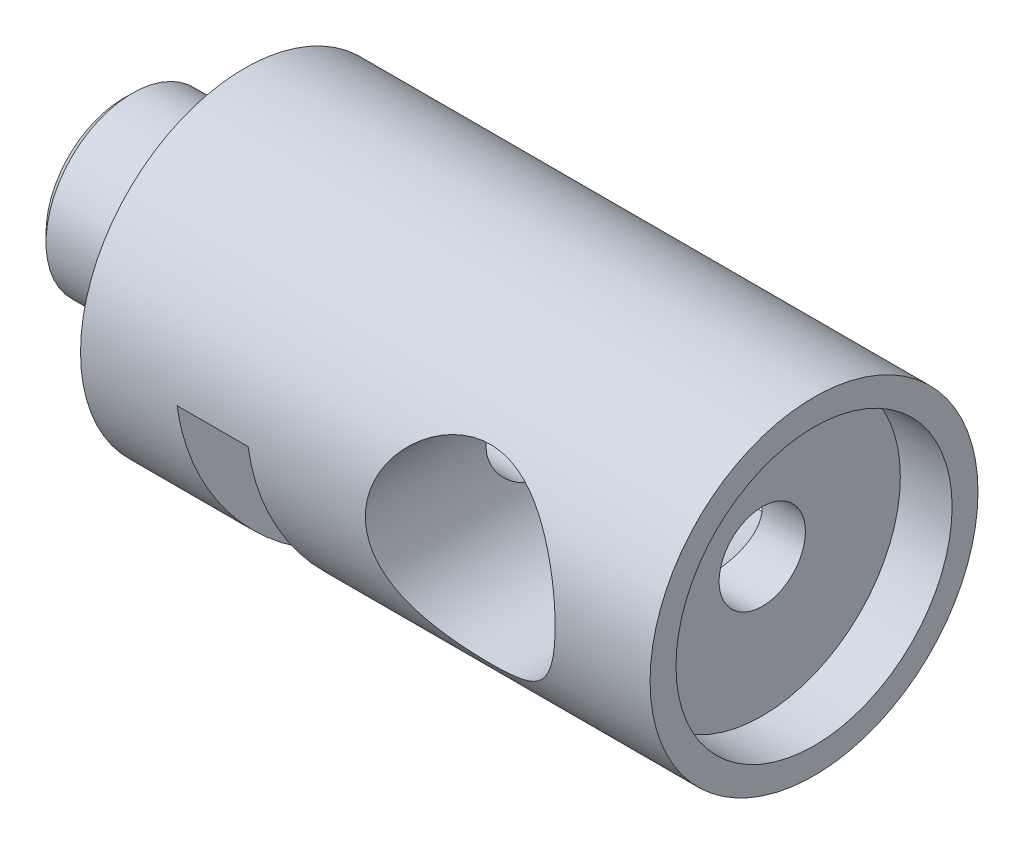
ISO-10303-21;
HEADER;
FILE_DESCRIPTION(('STEP AP214'),'2;1');
FILE_NAME('part.step','',(''),(''),'','','');
FILE_SCHEMA(('AUTOMOTIVE_DESIGN { 1 0 10303 214 1 1 1 1 }'));
ENDSEC;
DATA;
#1=APPLICATION_CONTEXT('core data for automotive mechanical design processes');
#2=APPLICATION_PROTOCOL_DEFINITION('international standard','automotive_design',2000,#1);
#3=PRODUCT_CONTEXT('',#1,'mechanical');
#4=PRODUCT('Part','Part','',(#3));
#5=PRODUCT_RELATED_PRODUCT_CATEGORY('part','',(#4));
#6=PRODUCT_DEFINITION_FORMATION('','',#4);
#7=PRODUCT_DEFINITION_CONTEXT('part definition',#1,'design');
#8=PRODUCT_DEFINITION('design','',#6,#7);
#9=PRODUCT_DEFINITION_SHAPE('','',#8);
#10=(LENGTH_UNIT() NAMED_UNIT(*) SI_UNIT(.MILLI.,.METRE.));
#11=(NAMED_UNIT(*) PLANE_ANGLE_UNIT() SI_UNIT($,.RADIAN.));
#12=(NAMED_UNIT(*) SI_UNIT($,.STERADIAN.) SOLID_ANGLE_UNIT());
#13=UNCERTAINTY_MEASURE_WITH_UNIT(LENGTH_MEASURE(1.E-05),#10,'distance_accuracy_value','');
#14=(GEOMETRIC_REPRESENTATION_CONTEXT(3) GLOBAL_UNCERTAINTY_ASSIGNED_CONTEXT((#13)) GLOBAL_UNIT_ASSIGNED_CONTEXT((#10,
#11,#12)) REPRESENTATION_CONTEXT('',''));
#15=CARTESIAN_POINT('',(0.,0.,0.));
#16=DIRECTION('',(0.,0.,1.));
#17=DIRECTION('',(1.,0.,0.));
#18=AXIS2_PLACEMENT_3D('',#15,#16,#17);
#19=CARTESIAN_POINT('',(-24.,0.,0.));
#20=DIRECTION('',(1.,0.,0.));
#21=DIRECTION('',(0.,0.,-1.));
#22=AXIS2_PLACEMENT_3D('',#19,#20,#21);
#23=PLANE('',#22);
#24=CARTESIAN_POINT('',(-24.,0.,0.));
#25=DIRECTION('',(-1.,0.,0.));
#26=DIRECTION('',(0.,0.,-1.));
#27=AXIS2_PLACEMENT_3D('',#24,#25,#26);
#28=CIRCLE('',#27,4.75);
#29=CARTESIAN_POINT('',(-24.,0.,-4.75));
#30=VERTEX_POINT('',#29);
#31=EDGE_CURVE('E455',#30,#30,#28,.T.);
#32=ORIENTED_EDGE('',*,*,#31,.T.);
#33=EDGE_LOOP('',(#32));
#34=FACE_BOUND('',#33,.T.);
#35=CARTESIAN_POINT('',(-24.,0.,0.));
#36=DIRECTION('',(1.,0.,0.));
#37=DIRECTION('',(0.,0.,-1.));
#38=AXIS2_PLACEMENT_3D('',#35,#36,#37);
#39=CIRCLE('',#38,2.5);
#40=CARTESIAN_POINT('',(-24.,0.,-2.5));
#41=VERTEX_POINT('',#40);
#42=EDGE_CURVE('E461',#41,#41,#39,.F.);
#43=ORIENTED_EDGE('',*,*,#42,.F.);
#44=EDGE_LOOP('',(#43));
#45=FACE_BOUND('',#44,.T.);
#46=ADVANCED_FACE('F362',(#34,#45),#23,.F.);
#47=CARTESIAN_POINT('',(-7.5,0.,0.));
#48=DIRECTION('',(-1.,0.,0.));
#49=DIRECTION('',(0.,0.,1.));
#50=AXIS2_PLACEMENT_3D('',#47,#48,#49);
#51=CYLINDRICAL_SURFACE('',#50,4.75);
#52=CARTESIAN_POINT('',(-10.25,0.,-4.75));
#53=CARTESIAN_POINT('',(-10.2500080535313,-0.141518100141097,-4.74999272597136));
#54=CARTESIAN_POINT('',(-10.260998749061,-0.283259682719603,-4.74360637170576));
#55=CARTESIAN_POINT('',(-10.3044182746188,-0.56249929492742,-4.71867095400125));
#56=CARTESIAN_POINT('',(-10.336898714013,-0.699986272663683,-4.70009261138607));
#57=CARTESIAN_POINT('',(-10.4215243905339,-0.966108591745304,-4.65266785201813));
#58=CARTESIAN_POINT('',(-10.4735760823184,-1.0947826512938,-4.62387031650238));
#59=CARTESIAN_POINT('',(-10.5953067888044,-1.34121485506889,-4.55849953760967));
#60=CARTESIAN_POINT('',(-10.6649816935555,-1.45897553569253,-4.52192810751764));
#61=CARTESIAN_POINT('',(-10.8256953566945,-1.69000944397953,-4.44099374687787));
#62=CARTESIAN_POINT('',(-10.917926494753,-1.80231953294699,-4.39625602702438));
#63=CARTESIAN_POINT('',(-11.1184882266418,-2.01081458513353,-4.30489379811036));
#64=CARTESIAN_POINT('',(-11.2268380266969,-2.10698001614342,-4.25826708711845));
#65=CARTESIAN_POINT('',(-11.47093413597,-2.29137846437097,-4.16221754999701));
#66=CARTESIAN_POINT('',(-11.6083905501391,-2.37750879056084,-4.11306851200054));
#67=CARTESIAN_POINT('',(-11.8987029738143,-2.52508415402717,-4.02416580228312));
#68=CARTESIAN_POINT('',(-12.051534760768,-2.58656728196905,-3.98439767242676));
#69=CARTESIAN_POINT('',(-12.3328426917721,-2.67091959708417,-3.92818686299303));
#70=CARTESIAN_POINT('',(-12.4589923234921,-2.69938120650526,-3.90850087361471));
#71=CARTESIAN_POINT('',(-12.7152769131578,-2.73828086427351,-3.88135349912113));
#72=CARTESIAN_POINT('',(-12.8454072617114,-2.74873901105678,-3.87387848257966));
#73=CARTESIAN_POINT('',(-13.1061129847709,-2.75104732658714,-3.87223991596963));
#74=CARTESIAN_POINT('',(-13.236688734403,-2.74286942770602,-3.87809644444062));
#75=CARTESIAN_POINT('',(-13.4942556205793,-2.70834331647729,-3.90228141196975));
#76=CARTESIAN_POINT('',(-13.6212441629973,-2.68198228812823,-3.92061864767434));
#77=CARTESIAN_POINT('',(-13.8677445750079,-2.61262939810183,-3.96716224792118));
#78=CARTESIAN_POINT('',(-13.9872968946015,-2.56973873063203,-3.9953084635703));
#79=CARTESIAN_POINT('',(-14.2178656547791,-2.46883826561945,-4.05843239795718));
#80=CARTESIAN_POINT('',(-14.3288788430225,-2.41082274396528,-4.09341270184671));
#81=CARTESIAN_POINT('',(-14.5585725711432,-2.27031384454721,-4.1732132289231));
#82=CARTESIAN_POINT('',(-14.6755205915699,-2.18536569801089,-4.21870613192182));
#83=CARTESIAN_POINT('',(-14.894634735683,-1.99841142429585,-4.31042096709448));
#84=CARTESIAN_POINT('',(-14.9967876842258,-1.8963902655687,-4.35664350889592));
#85=CARTESIAN_POINT('',(-15.1958540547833,-1.66339084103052,-4.45120209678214));
#86=CARTESIAN_POINT('',(-15.290661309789,-1.53040586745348,-4.49912422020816));
#87=CARTESIAN_POINT('',(-15.4147620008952,-1.31839139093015,-4.56397292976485));
#88=CARTESIAN_POINT('',(-15.4531223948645,-1.2455983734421,-4.58442360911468));
#89=CARTESIAN_POINT('',(-15.5233954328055,-1.09625352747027,-4.62240699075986));
#90=CARTESIAN_POINT('',(-15.5553119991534,-1.01970402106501,-4.63994146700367));
#91=CARTESIAN_POINT('',(-15.610351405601,-0.868668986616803,-4.6704868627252));
#92=CARTESIAN_POINT('',(-15.633921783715,-0.794391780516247,-4.68372293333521));
#93=CARTESIAN_POINT('',(-15.6747548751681,-0.643645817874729,-4.70680675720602));
#94=CARTESIAN_POINT('',(-15.6920210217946,-0.567178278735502,-4.71665635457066));
#95=CARTESIAN_POINT('',(-15.7199856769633,-0.41271125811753,-4.73267253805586));
#96=CARTESIAN_POINT('',(-15.7306881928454,-0.334712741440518,-4.73884137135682));
#97=CARTESIAN_POINT('',(-15.7453708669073,-0.177905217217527,-4.74731816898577));
#98=CARTESIAN_POINT('',(-15.7493518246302,-0.0990963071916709,-4.74962659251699));
#99=CARTESIAN_POINT('',(-15.7509287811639,0.11766230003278,-4.75053447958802));
#100=CARTESIAN_POINT('',(-15.7415235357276,0.25576524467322,-4.74506926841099));
#101=CARTESIAN_POINT('',(-15.7023494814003,0.52797359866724,-4.72254676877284));
#102=CARTESIAN_POINT('',(-15.67258049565,0.662078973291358,-4.70548937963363));
#103=CARTESIAN_POINT('',(-15.5946473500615,0.921055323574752,-4.66167074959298));
#104=CARTESIAN_POINT('',(-15.5467402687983,1.04602748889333,-4.63504537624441));
#105=CARTESIAN_POINT('',(-15.4342907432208,1.28620964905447,-4.57422549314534));
#106=CARTESIAN_POINT('',(-15.3697444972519,1.4014174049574,-4.54002925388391));
#107=CARTESIAN_POINT('',(-15.2182855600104,1.63176038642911,-4.46274678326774));
#108=CARTESIAN_POINT('',(-15.1297424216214,1.74563532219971,-4.41910537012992));
#109=CARTESIAN_POINT('',(-14.9365352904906,1.95779357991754,-4.32930102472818));
#110=CARTESIAN_POINT('',(-14.8318526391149,2.05605858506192,-4.28313521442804));
#111=CARTESIAN_POINT('',(-14.59499956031,2.24591366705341,-4.1869987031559));
#112=CARTESIAN_POINT('',(-14.4610473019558,2.33538971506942,-4.13721194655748));
#113=CARTESIAN_POINT('',(-14.1774426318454,2.49041291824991,-4.0457966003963));
#114=CARTESIAN_POINT('',(-14.0278105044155,2.55599050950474,-4.00415766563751));
#115=CARTESIAN_POINT('',(-13.7497105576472,2.64897483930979,-3.94307501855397));
#116=CARTESIAN_POINT('',(-13.6236020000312,2.68155533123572,-3.92078480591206));
#117=CARTESIAN_POINT('',(-13.366591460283,2.72857562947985,-3.88821531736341));
#118=CARTESIAN_POINT('',(-13.2356954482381,2.7430372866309,-3.87792157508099));
#119=CARTESIAN_POINT('',(-12.9724838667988,2.75302143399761,-3.87084210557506));
#120=CARTESIAN_POINT('',(-12.8401656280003,2.74849799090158,-3.87408913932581));
#121=CARTESIAN_POINT('',(-12.5784779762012,2.72069068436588,-3.89366312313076));
#122=CARTESIAN_POINT('',(-12.4491104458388,2.69739517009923,-3.90999819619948));
#123=CARTESIAN_POINT('',(-12.1999142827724,2.6341032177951,-3.95289740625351));
#124=CARTESIAN_POINT('',(-12.0799286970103,2.59453503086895,-3.97919797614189));
#125=CARTESIAN_POINT('',(-11.8480583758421,2.50024292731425,-4.03910842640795));
#126=CARTESIAN_POINT('',(-11.7361765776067,2.44551354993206,-4.07272093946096));
#127=CARTESIAN_POINT('',(-11.5052228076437,2.3126887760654,-4.14978647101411));
#128=CARTESIAN_POINT('',(-11.3877165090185,2.23228834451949,-4.19395738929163));
#129=CARTESIAN_POINT('',(-11.1667133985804,2.05467407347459,-4.28377540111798));
#130=CARTESIAN_POINT('',(-11.063229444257,1.95744498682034,-4.3294238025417));
#131=CARTESIAN_POINT('',(-10.8590511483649,1.73343125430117,-4.42429909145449));
#132=CARTESIAN_POINT('',(-10.7606058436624,1.60443008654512,-4.47318098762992));
#133=CARTESIAN_POINT('',(-10.5869586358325,1.32897131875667,-4.56258994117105));
#134=CARTESIAN_POINT('',(-10.511743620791,1.18252363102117,-4.60312170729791));
#135=CARTESIAN_POINT('',(-10.3990568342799,0.903358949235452,-4.66509600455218));
#136=CARTESIAN_POINT('',(-10.3572450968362,0.772854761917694,-4.68865424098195));
#137=CARTESIAN_POINT('',(-10.293459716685,0.505832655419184,-4.72489764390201));
#138=CARTESIAN_POINT('',(-10.2714309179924,0.36933257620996,-4.73761303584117));
#139=CARTESIAN_POINT('',(-10.2565296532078,0.193329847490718,-4.74622255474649));
#140=CARTESIAN_POINT('',(-10.2540836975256,0.154725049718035,-4.74763671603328));
#141=CARTESIAN_POINT('',(-10.2508176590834,0.0774190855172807,-4.74952649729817));
#142=CARTESIAN_POINT('',(-10.2499977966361,0.038717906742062,-4.75000199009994));
#143=CARTESIAN_POINT('',(-10.25,0.,-4.75));
#144=B_SPLINE_CURVE_WITH_KNOTS('',3,(#52,#53,#54,#55,#56,#57,#58,#59,#60,#61,#62,#63,#64,#65,
#66,#67,#68,#69,#70,#71,#72,#73,#74,#75,#76,#77,#78,#79,#80,#81,#82,#83,#84,#85,#86,#87,#88,#89,
#90,#91,#92,#93,#94,#95,#96,#97,#98,#99,#100,#101,#102,#103,#104,#105,#106,#107,#108,#109,#110,
#111,#112,#113,#114,#115,#116,#117,#118,#119,#120,#121,#122,#123,#124,#125,#126,#127,#128,#129,
#130,#131,#132,#133,#134,#135,#136,#137,#138,#139,#140,#141,#142,#143),.UNSPECIFIED.,.T.,.F.,(4,
2,2,2,2,2,2,2,2,2,2,2,2,2,2,2,2,2,2,2,2,2,2,2,2,2,2,2,2,2,2,2,2,2,2,2,2,2,2,2,2,2,2,2,2,4),(0.,
0.424391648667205,0.849806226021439,1.27321276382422,1.69652064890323,2.1508860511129,
2.6057972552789,3.11178128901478,3.61698031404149,4.00772417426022,4.39803153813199,
4.78892712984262,5.18009851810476,5.56891225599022,5.95787335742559,6.41068026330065,
6.86388795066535,7.3715782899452,7.62562931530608,7.87952522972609,8.11631815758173,
8.3529819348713,8.58950107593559,8.82599208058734,9.23933874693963,9.6526890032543,
10.0603876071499,10.4681794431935,10.9184944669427,11.3693340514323,11.8727379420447,
12.3754984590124,12.7702488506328,13.1645227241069,13.559751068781,13.9552248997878,
14.3408967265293,14.7267076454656,15.1722095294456,15.6181171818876,16.1240253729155,
16.6296474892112,17.0450477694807,17.4592862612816,17.5753797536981,17.6914889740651),.UNSPECIFIED.);
#145=CARTESIAN_POINT('',(-10.25,0.,-4.75));
#146=VERTEX_POINT('',#145);
#147=EDGE_CURVE('E541',#146,#146,#144,.T.);
#148=ORIENTED_EDGE('',*,*,#147,.F.);
#149=EDGE_LOOP('',(#148));
#150=FACE_BOUND('',#149,.T.);
#151=CARTESIAN_POINT('',(-10.25,0.,4.75));
#152=CARTESIAN_POINT('',(-10.2500080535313,0.141518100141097,4.74999272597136));
#153=CARTESIAN_POINT('',(-10.260998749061,0.283259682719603,4.74360637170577));
#154=CARTESIAN_POINT('',(-10.3044182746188,0.56249929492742,4.71867095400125));
#155=CARTESIAN_POINT('',(-10.336898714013,0.699986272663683,4.70009261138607));
#156=CARTESIAN_POINT('',(-10.4215243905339,0.966108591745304,4.65266785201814));
#157=CARTESIAN_POINT('',(-10.4735760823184,1.0947826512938,4.62387031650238));
#158=CARTESIAN_POINT('',(-10.5953067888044,1.34121485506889,4.55849953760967));
#159=CARTESIAN_POINT('',(-10.6649816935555,1.45897553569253,4.52192810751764));
#160=CARTESIAN_POINT('',(-10.8256953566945,1.69000944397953,4.44099374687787));
#161=CARTESIAN_POINT('',(-10.917926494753,1.80231953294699,4.39625602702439));
#162=CARTESIAN_POINT('',(-11.1184882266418,2.01081458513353,4.30489379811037));
#163=CARTESIAN_POINT('',(-11.2268380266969,2.10698001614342,4.25826708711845));
#164=CARTESIAN_POINT('',(-11.47093413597,2.29137846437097,4.16221754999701));
#165=CARTESIAN_POINT('',(-11.6083905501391,2.37750879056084,4.11306851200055));
#166=CARTESIAN_POINT('',(-11.8987029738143,2.52508415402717,4.02416580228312));
#167=CARTESIAN_POINT('',(-12.051534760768,2.58656728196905,3.98439767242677));
#168=CARTESIAN_POINT('',(-12.3328426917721,2.67091959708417,3.92818686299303));
#169=CARTESIAN_POINT('',(-12.4589923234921,2.69938120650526,3.90850087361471));
#170=CARTESIAN_POINT('',(-12.7152769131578,2.73828086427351,3.88135349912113));
#171=CARTESIAN_POINT('',(-12.8454072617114,2.74873901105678,3.87387848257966));
#172=CARTESIAN_POINT('',(-13.1061129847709,2.75104732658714,3.87223991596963));
#173=CARTESIAN_POINT('',(-13.236688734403,2.74286942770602,3.87809644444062));
#174=CARTESIAN_POINT('',(-13.4942556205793,2.70834331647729,3.90228141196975));
#175=CARTESIAN_POINT('',(-13.6212441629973,2.68198228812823,3.92061864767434));
#176=CARTESIAN_POINT('',(-13.8677445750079,2.61262939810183,3.96716224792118));
#177=CARTESIAN_POINT('',(-13.9872968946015,2.56973873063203,3.99530846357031));
#178=CARTESIAN_POINT('',(-14.2178656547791,2.46883826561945,4.05843239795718));
#179=CARTESIAN_POINT('',(-14.3288788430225,2.41082274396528,4.09341270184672));
#180=CARTESIAN_POINT('',(-14.5585725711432,2.27031384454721,4.1732132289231));
#181=CARTESIAN_POINT('',(-14.6755205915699,2.18536569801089,4.21870613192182));
#182=CARTESIAN_POINT('',(-14.894634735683,1.99841142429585,4.31042096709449));
#183=CARTESIAN_POINT('',(-14.9967876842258,1.8963902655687,4.35664350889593));
#184=CARTESIAN_POINT('',(-15.1958540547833,1.66339084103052,4.45120209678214));
#185=CARTESIAN_POINT('',(-15.290661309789,1.53040586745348,4.49912422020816));
#186=CARTESIAN_POINT('',(-15.4147620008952,1.31839139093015,4.56397292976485));
#187=CARTESIAN_POINT('',(-15.4531223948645,1.2455983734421,4.58442360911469));
#188=CARTESIAN_POINT('',(-15.5233954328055,1.09625352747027,4.62240699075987));
#189=CARTESIAN_POINT('',(-15.5553119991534,1.01970402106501,4.63994146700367));
#190=CARTESIAN_POINT('',(-15.610351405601,0.868668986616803,4.67048686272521));
#191=CARTESIAN_POINT('',(-15.633921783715,0.794391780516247,4.68372293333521));
#192=CARTESIAN_POINT('',(-15.6747548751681,0.643645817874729,4.70680675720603));
#193=CARTESIAN_POINT('',(-15.6920210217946,0.567178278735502,4.71665635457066));
#194=CARTESIAN_POINT('',(-15.7199856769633,0.41271125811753,4.73267253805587));
#195=CARTESIAN_POINT('',(-15.7306881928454,0.334712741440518,4.73884137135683));
#196=CARTESIAN_POINT('',(-15.7453708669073,0.177905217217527,4.74731816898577));
#197=CARTESIAN_POINT('',(-15.7493518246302,0.0990963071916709,4.749626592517));
#198=CARTESIAN_POINT('',(-15.7509287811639,-0.11766230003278,4.75053447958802));
#199=CARTESIAN_POINT('',(-15.7415235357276,-0.25576524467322,4.745069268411));
#200=CARTESIAN_POINT('',(-15.7023494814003,-0.52797359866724,4.72254676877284));
#201=CARTESIAN_POINT('',(-15.67258049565,-0.662078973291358,4.70548937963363));
#202=CARTESIAN_POINT('',(-15.5946473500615,-0.921055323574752,4.66167074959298));
#203=CARTESIAN_POINT('',(-15.5467402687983,-1.04602748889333,4.63504537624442));
#204=CARTESIAN_POINT('',(-15.4342907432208,-1.28620964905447,4.57422549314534));
#205=CARTESIAN_POINT('',(-15.3697444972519,-1.4014174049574,4.54002925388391));
#206=CARTESIAN_POINT('',(-15.2182855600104,-1.63176038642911,4.46274678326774));
#207=CARTESIAN_POINT('',(-15.1297424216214,-1.74563532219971,4.41910537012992));
#208=CARTESIAN_POINT('',(-14.9365352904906,-1.95779357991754,4.32930102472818));
#209=CARTESIAN_POINT('',(-14.8318526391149,-2.05605858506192,4.28313521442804));
#210=CARTESIAN_POINT('',(-14.59499956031,-2.24591366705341,4.1869987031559));
#211=CARTESIAN_POINT('',(-14.4610473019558,-2.33538971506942,4.13721194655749));
#212=CARTESIAN_POINT('',(-14.1774426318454,-2.49041291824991,4.0457966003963));
#213=CARTESIAN_POINT('',(-14.0278105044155,-2.55599050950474,4.00415766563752));
#214=CARTESIAN_POINT('',(-13.7497105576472,-2.64897483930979,3.94307501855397));
#215=CARTESIAN_POINT('',(-13.6236020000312,-2.68155533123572,3.92078480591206));
#216=CARTESIAN_POINT('',(-13.366591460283,-2.72857562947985,3.88821531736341));
#217=CARTESIAN_POINT('',(-13.2356954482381,-2.7430372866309,3.87792157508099));
#218=CARTESIAN_POINT('',(-12.9724838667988,-2.75302143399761,3.87084210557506));
#219=CARTESIAN_POINT('',(-12.8401656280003,-2.74849799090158,3.87408913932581));
#220=CARTESIAN_POINT('',(-12.5784779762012,-2.72069068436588,3.89366312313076));
#221=CARTESIAN_POINT('',(-12.4491104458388,-2.69739517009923,3.90999819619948));
#222=CARTESIAN_POINT('',(-12.1999142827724,-2.6341032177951,3.95289740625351));
#223=CARTESIAN_POINT('',(-12.0799286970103,-2.59453503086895,3.9791979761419));
#224=CARTESIAN_POINT('',(-11.8480583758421,-2.50024292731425,4.03910842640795));
#225=CARTESIAN_POINT('',(-11.7361765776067,-2.44551354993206,4.07272093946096));
#226=CARTESIAN_POINT('',(-11.5052228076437,-2.3126887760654,4.14978647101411));
#227=CARTESIAN_POINT('',(-11.3877165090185,-2.23228834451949,4.19395738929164));
#228=CARTESIAN_POINT('',(-11.1667133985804,-2.05467407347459,4.28377540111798));
#229=CARTESIAN_POINT('',(-11.063229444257,-1.95744498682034,4.32942380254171));
#230=CARTESIAN_POINT('',(-10.8590511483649,-1.73343125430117,4.42429909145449));
#231=CARTESIAN_POINT('',(-10.7606058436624,-1.60443008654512,4.47318098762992));
#232=CARTESIAN_POINT('',(-10.5869586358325,-1.32897131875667,4.56258994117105));
#233=CARTESIAN_POINT('',(-10.511743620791,-1.18252363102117,4.60312170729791));
#234=CARTESIAN_POINT('',(-10.3990568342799,-0.903358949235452,4.66509600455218));
#235=CARTESIAN_POINT('',(-10.3572450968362,-0.772854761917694,4.68865424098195));
#236=CARTESIAN_POINT('',(-10.293459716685,-0.505832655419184,4.72489764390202));
#237=CARTESIAN_POINT('',(-10.2714309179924,-0.36933257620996,4.73761303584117));
#238=CARTESIAN_POINT('',(-10.2565296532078,-0.193329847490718,4.74622255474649));
#239=CARTESIAN_POINT('',(-10.2540836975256,-0.154725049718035,4.74763671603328));
#240=CARTESIAN_POINT('',(-10.2508176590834,-0.0774190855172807,4.74952649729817));
#241=CARTESIAN_POINT('',(-10.2499977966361,-0.038717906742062,4.75000199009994));
#242=CARTESIAN_POINT('',(-10.25,0.,4.75));
#243=B_SPLINE_CURVE_WITH_KNOTS('',3,(#151,#152,#153,#154,#155,#156,#157,#158,#159,#160,#161,
#162,#163,#164,#165,#166,#167,#168,#169,#170,#171,#172,#173,#174,#175,#176,#177,#178,#179,#180,
#181,#182,#183,#184,#185,#186,#187,#188,#189,#190,#191,#192,#193,#194,#195,#196,#197,#198,#199,
#200,#201,#202,#203,#204,#205,#206,#207,#208,#209,#210,#211,#212,#213,#214,#215,#216,#217,#218,
#219,#220,#221,#222,#223,#224,#225,#226,#227,#228,#229,#230,#231,#232,#233,#234,#235,#236,#237,
#238,#239,#240,#241,#242),.UNSPECIFIED.,.T.,.F.,(4,2,2,2,2,2,2,2,2,2,2,2,2,2,2,2,2,2,2,2,2,2,2,
2,2,2,2,2,2,2,2,2,2,2,2,2,2,2,2,2,2,2,2,2,2,4),(0.,0.424391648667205,0.849806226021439,
1.27321276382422,1.69652064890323,2.1508860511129,2.6057972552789,3.11178128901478,
3.61698031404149,4.00772417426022,4.39803153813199,4.78892712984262,5.18009851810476,
5.56891225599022,5.95787335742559,6.41068026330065,6.86388795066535,7.3715782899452,
7.62562931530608,7.87952522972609,8.11631815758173,8.35298193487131,8.58950107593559,
8.82599208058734,9.23933874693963,9.6526890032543,10.0603876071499,10.4681794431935,
10.9184944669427,11.3693340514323,11.8727379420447,12.3754984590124,12.7702488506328,
13.1645227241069,13.559751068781,13.9552248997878,14.3408967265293,14.7267076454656,
15.1722095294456,15.6181171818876,16.1240253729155,16.6296474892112,17.0450477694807,
17.4592862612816,17.5753797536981,17.6914889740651),.UNSPECIFIED.);
#244=CARTESIAN_POINT('',(-10.25,0.,4.75));
#245=VERTEX_POINT('',#244);
#246=EDGE_CURVE('E552',#245,#245,#243,.T.);
#247=ORIENTED_EDGE('',*,*,#246,.F.);
#248=EDGE_LOOP('',(#247));
#249=FACE_BOUND('',#248,.T.);
#250=DIRECTION('',(-1.,0.,0.));
#251=VECTOR('',#250,1.);
#252=CARTESIAN_POINT('',(-7.50000000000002,-4.74963742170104,-0.0586886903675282));
#253=LINE('',#252,#251);
#254=CARTESIAN_POINT('',(-17.5441149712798,-4.74963742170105,-0.0586886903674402));
#255=VERTEX_POINT('',#254);
#256=CARTESIAN_POINT('',(-19.5988125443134,-4.74963742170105,-0.0586886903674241));
#257=VERTEX_POINT('',#256);
#258=EDGE_CURVE('E414',#255,#257,#253,.T.);
#259=ORIENTED_EDGE('',*,*,#258,.T.);
#260=CARTESIAN_POINT('',(-20.3994062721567,0.,0.));
#261=DIRECTION('',(-0.973379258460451,-0.162069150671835,-0.162069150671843));
#262=DIRECTION('',(-0.229200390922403,0.688283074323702,0.688283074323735));
#263=AXIS2_PLACEMENT_3D('',#260,#261,#262);
#264=ELLIPSE('',#263,4.87990673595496,4.75);
#265=CARTESIAN_POINT('',(-21.2,0.0586886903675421,4.74963742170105));
#266=VERTEX_POINT('',#265);
#267=EDGE_CURVE('E403',#257,#266,#264,.T.);
#268=ORIENTED_EDGE('',*,*,#267,.T.);
#269=DIRECTION('',(-1.,0.,0.));
#270=VECTOR('',#269,1.);
#271=CARTESIAN_POINT('',(-7.49999999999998,0.058688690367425,4.74963742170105));
#272=LINE('',#271,#270);
#273=CARTESIAN_POINT('',(-19.1453024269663,0.058688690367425,4.74963742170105));
#274=VERTEX_POINT('',#273);
#275=EDGE_CURVE('E424',#266,#274,#272,.F.);
#276=ORIENTED_EDGE('',*,*,#275,.T.);
#277=CARTESIAN_POINT('',(-18.344708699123,0.,0.));
#278=DIRECTION('',(0.973379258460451,0.162069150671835,0.162069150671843));
#279=DIRECTION('',(-0.229200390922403,0.688283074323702,0.688283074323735));
#280=AXIS2_PLACEMENT_3D('',#277,#278,#279);
#281=ELLIPSE('',#280,4.87990673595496,4.75);
#282=EDGE_CURVE('E420',#274,#255,#281,.T.);
#283=ORIENTED_EDGE('',*,*,#282,.T.);
#284=EDGE_LOOP('',(#259,#268,#276,#283));
#285=FACE_BOUND('',#284,.T.);
#286=CARTESIAN_POINT('',(-7.5,0.,0.));
#287=DIRECTION('',(-1.,0.,0.));
#288=DIRECTION('',(0.,0.,-1.));
#289=AXIS2_PLACEMENT_3D('',#286,#287,#288);
#290=CIRCLE('',#289,4.75);
#291=CARTESIAN_POINT('',(-7.5,0.,-4.75));
#292=VERTEX_POINT('',#291);
#293=EDGE_CURVE('E458',#292,#292,#290,.T.);
#294=ORIENTED_EDGE('',*,*,#293,.T.);
#295=EDGE_LOOP('',(#294));
#296=FACE_BOUND('',#295,.T.);
#297=ORIENTED_EDGE('',*,*,#31,.F.);
#298=EDGE_LOOP('',(#297));
#299=FACE_BOUND('',#298,.T.);
#300=ADVANCED_FACE('F364',(#150,#249,#285,#296,#299),#51,.T.);
#301=CARTESIAN_POINT('',(-7.5,0.,0.));
#302=DIRECTION('',(1.,0.,0.));
#303=DIRECTION('',(0.,0.,-1.));
#304=AXIS2_PLACEMENT_3D('',#301,#302,#303);
#305=PLANE('',#304);
#306=CARTESIAN_POINT('',(-7.5,0.,0.));
#307=DIRECTION('',(1.,0.,0.));
#308=DIRECTION('',(0.,0.,-1.));
#309=AXIS2_PLACEMENT_3D('',#306,#307,#308);
#310=CIRCLE('',#309,4.00000000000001);
#311=CARTESIAN_POINT('',(-7.5,0.,-4.00000000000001));
#312=VERTEX_POINT('',#311);
#313=EDGE_CURVE('E443',#312,#312,#310,.T.);
#314=ORIENTED_EDGE('',*,*,#313,.F.);
#315=EDGE_LOOP('',(#314));
#316=FACE_BOUND('',#315,.T.);
#317=ORIENTED_EDGE('',*,*,#293,.F.);
#318=EDGE_LOOP('',(#317));
#319=FACE_BOUND('',#318,.T.);
#320=ADVANCED_FACE('F490',(#316,#319),#305,.T.);
#321=CARTESIAN_POINT('',(-27.5,0.,0.));
#322=DIRECTION('',(1.,0.,0.));
#323=DIRECTION('',(0.,0.,-1.));
#324=AXIS2_PLACEMENT_3D('',#321,#322,#323);
#325=CYLINDRICAL_SURFACE('',#324,2.5);
#326=CARTESIAN_POINT('',(-27.25,0.,0.));
#327=DIRECTION('',(-1.,0.,0.));
#328=DIRECTION('',(0.,0.,1.));
#329=AXIS2_PLACEMENT_3D('',#326,#327,#328);
#330=CIRCLE('',#329,2.5);
#331=CARTESIAN_POINT('',(-27.25,0.,-2.5));
#332=VERTEX_POINT('',#331);
#333=EDGE_CURVE('E11',#332,#332,#330,.F.);
#334=CARTESIAN_POINT('',(-27.25,0.,-2.5));
#335=CARTESIAN_POINT('',(-27.2161458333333,0.,-2.5));
#336=CARTESIAN_POINT('',(-27.1822916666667,0.,-2.5));
#337=CARTESIAN_POINT('',(-27.1145833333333,0.,-2.5));
#338=CARTESIAN_POINT('',(-27.0807291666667,0.,-2.5));
#339=CARTESIAN_POINT('',(-27.0130208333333,0.,-2.5));
#340=CARTESIAN_POINT('',(-26.9791666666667,0.,-2.5));
#341=CARTESIAN_POINT('',(-26.9114583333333,0.,-2.5));
#342=CARTESIAN_POINT('',(-26.8776041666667,0.,-2.5));
#343=CARTESIAN_POINT('',(-26.8098958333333,0.,-2.5));
#344=CARTESIAN_POINT('',(-26.7760416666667,0.,-2.5));
#345=CARTESIAN_POINT('',(-26.7083333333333,0.,-2.5));
#346=CARTESIAN_POINT('',(-26.6744791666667,0.,-2.5));
#347=CARTESIAN_POINT('',(-26.6067708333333,0.,-2.5));
#348=CARTESIAN_POINT('',(-26.5729166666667,0.,-2.5));
#349=CARTESIAN_POINT('',(-26.5052083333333,0.,-2.5));
#350=CARTESIAN_POINT('',(-26.4713541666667,0.,-2.5));
#351=CARTESIAN_POINT('',(-26.4036458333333,0.,-2.5));
#352=CARTESIAN_POINT('',(-26.3697916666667,0.,-2.5));
#353=CARTESIAN_POINT('',(-26.3020833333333,0.,-2.5));
#354=CARTESIAN_POINT('',(-26.2682291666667,0.,-2.5));
#355=CARTESIAN_POINT('',(-26.2005208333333,0.,-2.5));
#356=CARTESIAN_POINT('',(-26.1666666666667,0.,-2.5));
#357=CARTESIAN_POINT('',(-26.0989583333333,0.,-2.5));
#358=CARTESIAN_POINT('',(-26.0651041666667,0.,-2.5));
#359=CARTESIAN_POINT('',(-25.9973958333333,0.,-2.5));
#360=CARTESIAN_POINT('',(-25.9635416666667,0.,-2.5));
#361=CARTESIAN_POINT('',(-25.8958333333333,0.,-2.5));
#362=CARTESIAN_POINT('',(-25.8619791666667,0.,-2.5));
#363=CARTESIAN_POINT('',(-25.7942708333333,0.,-2.5));
#364=CARTESIAN_POINT('',(-25.7604166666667,0.,-2.5));
#365=CARTESIAN_POINT('',(-25.6927083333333,0.,-2.5));
#366=CARTESIAN_POINT('',(-25.6588541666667,0.,-2.5));
#367=CARTESIAN_POINT('',(-25.5911458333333,0.,-2.5));
#368=CARTESIAN_POINT('',(-25.5572916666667,0.,-2.5));
#369=CARTESIAN_POINT('',(-25.4895833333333,0.,-2.5));
#370=CARTESIAN_POINT('',(-25.4557291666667,0.,-2.5));
#371=CARTESIAN_POINT('',(-25.3880208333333,0.,-2.5));
#372=CARTESIAN_POINT('',(-25.3541666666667,0.,-2.5));
#373=CARTESIAN_POINT('',(-25.2864583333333,0.,-2.5));
#374=CARTESIAN_POINT('',(-25.2526041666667,0.,-2.5));
#375=CARTESIAN_POINT('',(-25.1848958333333,0.,-2.5));
#376=CARTESIAN_POINT('',(-25.1510416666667,0.,-2.5));
#377=CARTESIAN_POINT('',(-25.0833333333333,0.,-2.5));
#378=CARTESIAN_POINT('',(-25.0494791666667,0.,-2.5));
#379=CARTESIAN_POINT('',(-24.9817708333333,0.,-2.5));
#380=CARTESIAN_POINT('',(-24.9479166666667,0.,-2.5));
#381=CARTESIAN_POINT('',(-24.8802083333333,0.,-2.5));
#382=CARTESIAN_POINT('',(-24.8463541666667,0.,-2.5));
#383=CARTESIAN_POINT('',(-24.7786458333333,0.,-2.5));
#384=CARTESIAN_POINT('',(-24.7447916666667,0.,-2.5));
#385=CARTESIAN_POINT('',(-24.6770833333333,0.,-2.5));
#386=CARTESIAN_POINT('',(-24.6432291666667,0.,-2.5));
#387=CARTESIAN_POINT('',(-24.5755208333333,0.,-2.5));
#388=CARTESIAN_POINT('',(-24.5416666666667,0.,-2.5));
#389=CARTESIAN_POINT('',(-24.4739583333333,0.,-2.5));
#390=CARTESIAN_POINT('',(-24.4401041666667,0.,-2.5));
#391=CARTESIAN_POINT('',(-24.3723958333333,0.,-2.5));
#392=CARTESIAN_POINT('',(-24.3385416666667,0.,-2.5));
#393=CARTESIAN_POINT('',(-24.2708333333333,0.,-2.5));
#394=CARTESIAN_POINT('',(-24.2369791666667,0.,-2.5));
#395=CARTESIAN_POINT('',(-24.1692708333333,0.,-2.5));
#396=CARTESIAN_POINT('',(-24.1354166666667,0.,-2.5));
#397=CARTESIAN_POINT('',(-24.0677083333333,0.,-2.5));
#398=CARTESIAN_POINT('',(-24.0338541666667,0.,-2.5));
#399=CARTESIAN_POINT('',(-24.,0.,-2.5));
#400=B_SPLINE_CURVE_WITH_KNOTS('',3,(#334,#335,#336,#337,#338,#339,#340,#341,#342,#343,#344,
#345,#346,#347,#348,#349,#350,#351,#352,#353,#354,#355,#356,#357,#358,#359,#360,#361,#362,#363,
#364,#365,#366,#367,#368,#369,#370,#371,#372,#373,#374,#375,#376,#377,#378,#379,#380,#381,#382,
#383,#384,#385,#386,#387,#388,#389,#390,#391,#392,#393,#394,#395,#396,#397,#398,#399),
.UNSPECIFIED.,.F.,.F.,(4,2,2,2,2,2,2,2,2,2,2,2,2,2,2,2,2,2,2,2,2,2,2,2,2,2,2,2,2,2,2,2,4),(0.,
0.101562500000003,0.203125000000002,0.304687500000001,0.40625,0.5078125,0.609375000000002,
0.710937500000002,0.812500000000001,0.9140625,1.015625,1.1171875,1.21875,1.3203125,1.421875,
1.5234375,1.625,1.7265625,1.828125,1.9296875,2.03125,2.1328125,2.234375,2.3359375,2.4375,
2.5390625,2.640625,2.7421875,2.84375,2.9453125,3.046875,3.1484375,3.25),.UNSPECIFIED.);
#401=EDGE_CURVE('BSEAM494',#332,#41,#400,.T.);
#402=ORIENTED_EDGE('',*,*,#333,.T.);
#403=ORIENTED_EDGE('',*,*,#42,.T.);
#404=ORIENTED_EDGE('',*,*,#401,.T.);
#405=ORIENTED_EDGE('',*,*,#401,.F.);
#406=EDGE_LOOP('',(#402,#404,#403,#405));
#407=FACE_BOUND('',#406,.T.);
#408=ADVANCED_FACE('F494',(#407),#325,.T.);
#409=CARTESIAN_POINT('',(-27.5,0.,0.));
#410=DIRECTION('',(-1.,0.,0.));
#411=DIRECTION('',(0.,0.,1.));
#412=AXIS2_PLACEMENT_3D('',#409,#410,#411);
#413=PLANE('',#412);
#414=CARTESIAN_POINT('',(-27.5,0.,0.));
#415=DIRECTION('',(-1.,0.,0.));
#416=DIRECTION('',(0.,0.,1.));
#417=AXIS2_PLACEMENT_3D('',#414,#415,#416);
#418=CIRCLE('',#417,2.25);
#419=CARTESIAN_POINT('',(-27.5,0.,2.25));
#420=VERTEX_POINT('',#419);
#421=EDGE_CURVE('E371',#420,#420,#418,.T.);
#422=ORIENTED_EDGE('',*,*,#421,.T.);
#423=EDGE_LOOP('',(#422));
#424=FACE_BOUND('',#423,.T.);
#425=CARTESIAN_POINT('',(-27.5,0.,0.));
#426=DIRECTION('',(-1.,0.,0.));
#427=DIRECTION('',(0.,0.,1.));
#428=AXIS2_PLACEMENT_3D('',#425,#426,#427);
#429=CIRCLE('',#428,1.60000000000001);
#430=CARTESIAN_POINT('',(-27.5,0.,1.60000000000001));
#431=VERTEX_POINT('',#430);
#432=EDGE_CURVE('E446',#431,#431,#429,.T.);
#433=ORIENTED_EDGE('',*,*,#432,.F.);
#434=EDGE_LOOP('',(#433));
#435=FACE_BOUND('',#434,.T.);
#436=ADVANCED_FACE('F466',(#424,#435),#413,.T.);
#437=CARTESIAN_POINT('',(-27.5,0.,0.));
#438=DIRECTION('',(-1.,0.,0.));
#439=DIRECTION('',(0.,0.,1.));
#440=AXIS2_PLACEMENT_3D('',#437,#438,#439);
#441=CYLINDRICAL_SURFACE('',#440,1.25000000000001);
#442=CARTESIAN_POINT('',(-15.4494897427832,-1.24999999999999,0.));
#443=CARTESIAN_POINT('',(-15.4494936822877,-1.24999649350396,-0.0660084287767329));
#444=CARTESIAN_POINT('',(-15.4521970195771,-1.24473782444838,-0.132119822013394));
#445=CARTESIAN_POINT('',(-15.4626409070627,-1.22393957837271,-0.262382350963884));
#446=CARTESIAN_POINT('',(-15.470393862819,-1.20837468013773,-0.326528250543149));
#447=CARTESIAN_POINT('',(-15.4898625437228,-1.16772642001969,-0.45073853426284));
#448=CARTESIAN_POINT('',(-15.5015599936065,-1.14268689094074,-0.510820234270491));
#449=CARTESIAN_POINT('',(-15.527571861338,-1.08393224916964,-0.6259150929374));
#450=CARTESIAN_POINT('',(-15.5418860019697,-1.05021805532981,-0.68092878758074));
#451=CARTESIAN_POINT('',(-15.572706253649,-0.972392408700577,-0.788447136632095));
#452=CARTESIAN_POINT('',(-15.5892951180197,-0.927732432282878,-0.840531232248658));
#453=CARTESIAN_POINT('',(-15.6221216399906,-0.830430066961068,-0.93678827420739));
#454=CARTESIAN_POINT('',(-15.6383591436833,-0.77778425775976,-0.980957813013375));
#455=CARTESIAN_POINT('',(-15.6696924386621,-0.662562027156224,-1.06242556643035));
#456=CARTESIAN_POINT('',(-15.6846810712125,-0.599605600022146,-1.09923134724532));
#457=CARTESIAN_POINT('',(-15.7107891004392,-0.467587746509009,-1.16154249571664));
#458=CARTESIAN_POINT('',(-15.7219105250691,-0.398529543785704,-1.18705378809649));
#459=CARTESIAN_POINT('',(-15.7384403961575,-0.260702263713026,-1.2244671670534));
#460=CARTESIAN_POINT('',(-15.7441539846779,-0.192168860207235,-1.23709974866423));
#461=CARTESIAN_POINT('',(-15.7503461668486,-0.053733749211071,-1.25077724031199));
#462=CARTESIAN_POINT('',(-15.7508273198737,0.0161672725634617,-1.25182781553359));
#463=CARTESIAN_POINT('',(-15.7466651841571,0.149965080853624,-1.24265098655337));
#464=CARTESIAN_POINT('',(-15.7423892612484,0.213931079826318,-1.23323213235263));
#465=CARTESIAN_POINT('',(-15.7297201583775,0.339258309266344,-1.2047960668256));
#466=CARTESIAN_POINT('',(-15.7213266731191,0.400619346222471,-1.18577814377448));
#467=CARTESIAN_POINT('',(-15.7010549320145,0.52012962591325,-1.13848998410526));
#468=CARTESIAN_POINT('',(-15.6891258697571,0.578216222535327,-1.11008410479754));
#469=CARTESIAN_POINT('',(-15.6629101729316,0.688949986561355,-1.04497733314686));
#470=CARTESIAN_POINT('',(-15.6486226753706,0.741595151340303,-1.0082734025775));
#471=CARTESIAN_POINT('',(-15.6177092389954,0.844521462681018,-0.92415024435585));
#472=CARTESIAN_POINT('',(-15.6009876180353,0.894259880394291,-0.876101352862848));
#473=CARTESIAN_POINT('',(-15.5679097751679,0.985234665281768,-0.772382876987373));
#474=CARTESIAN_POINT('',(-15.551553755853,1.02646641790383,-0.71670918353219));
#475=CARTESIAN_POINT('',(-15.5202997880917,1.10104506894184,-0.596190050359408));
#476=CARTESIAN_POINT('',(-15.5055011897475,1.13395121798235,-0.531043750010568));
#477=CARTESIAN_POINT('',(-15.4802879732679,1.18809667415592,-0.395289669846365));
#478=CARTESIAN_POINT('',(-15.469869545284,1.20934612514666,-0.324686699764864));
#479=CARTESIAN_POINT('',(-15.4555983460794,1.23805393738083,-0.18547178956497));
#480=CARTESIAN_POINT('',(-15.4513236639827,1.2464018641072,-0.117087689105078));
#481=CARTESIAN_POINT('',(-15.4486133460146,1.25172089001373,0.0202232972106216));
#482=CARTESIAN_POINT('',(-15.4501749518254,1.24869736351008,0.0891499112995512));
#483=CARTESIAN_POINT('',(-15.4585192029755,1.23217422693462,0.219568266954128));
#484=CARTESIAN_POINT('',(-15.4648605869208,1.21955926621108,0.281204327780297));
#485=CARTESIAN_POINT('',(-15.4814470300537,1.18544405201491,0.401407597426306));
#486=CARTESIAN_POINT('',(-15.4916931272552,1.16394143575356,0.459973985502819));
#487=CARTESIAN_POINT('',(-15.5154937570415,1.11159822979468,0.575365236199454));
#488=CARTESIAN_POINT('',(-15.5291773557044,1.08037807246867,0.631990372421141));
#489=CARTESIAN_POINT('',(-15.558158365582,1.00984087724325,0.739499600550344));
#490=CARTESIAN_POINT('',(-15.5734565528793,0.970519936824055,0.790380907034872));
#491=CARTESIAN_POINT('',(-15.6057909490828,0.880267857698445,0.890281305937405));
#492=CARTESIAN_POINT('',(-15.622847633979,0.828567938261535,0.938602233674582));
#493=CARTESIAN_POINT('',(-15.6553959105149,0.717441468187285,1.02604911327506));
#494=CARTESIAN_POINT('',(-15.6708872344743,0.658013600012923,1.06517349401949));
#495=CARTESIAN_POINT('',(-15.6988161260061,0.532064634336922,1.13339748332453));
#496=CARTESIAN_POINT('',(-15.7112176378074,0.465471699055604,1.16238019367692));
#497=CARTESIAN_POINT('',(-15.7312983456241,0.327635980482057,1.20848045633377));
#498=CARTESIAN_POINT('',(-15.7389809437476,0.256396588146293,1.22560655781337));
#499=CARTESIAN_POINT('',(-15.7483006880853,0.117466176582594,1.24628759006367));
#500=CARTESIAN_POINT('',(-15.7503736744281,0.0499494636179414,1.25082169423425));
#501=CARTESIAN_POINT('',(-15.7495153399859,-0.0848898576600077,1.24893412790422));
#502=CARTESIAN_POINT('',(-15.7465852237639,-0.152212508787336,1.24251509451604));
#503=CARTESIAN_POINT('',(-15.7362969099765,-0.281391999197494,1.21959722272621));
#504=CARTESIAN_POINT('',(-15.7291576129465,-0.343356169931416,1.20359609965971));
#505=CARTESIAN_POINT('',(-15.7113127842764,-0.463664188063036,1.16256495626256));
#506=CARTESIAN_POINT('',(-15.7006066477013,-0.522007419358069,1.13753340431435));
#507=CARTESIAN_POINT('',(-15.6760233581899,-0.636378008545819,1.07790145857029));
#508=CARTESIAN_POINT('',(-15.6620235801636,-0.692177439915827,1.04291581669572));
#509=CARTESIAN_POINT('',(-15.6324339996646,-0.797359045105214,0.964889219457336));
#510=CARTESIAN_POINT('',(-15.6168435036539,-0.846738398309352,0.92184474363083));
#511=CARTESIAN_POINT('',(-15.5841761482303,-0.941951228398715,0.824757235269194));
#512=CARTESIAN_POINT('',(-15.5670829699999,-0.987154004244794,0.770099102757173));
#513=CARTESIAN_POINT('',(-15.5345591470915,-1.06790018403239,0.65354140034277));
#514=CARTESIAN_POINT('',(-15.5191296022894,-1.10343722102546,0.591637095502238));
#515=CARTESIAN_POINT('',(-15.4917656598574,-1.16392442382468,0.461487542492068));
#516=CARTESIAN_POINT('',(-15.4798600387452,-1.18878813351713,0.393195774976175));
#517=CARTESIAN_POINT('',(-15.4615227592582,-1.22631765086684,0.252764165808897));
#518=CARTESIAN_POINT('',(-15.4550727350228,-1.23902440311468,0.180638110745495));
#519=CARTESIAN_POINT('',(-15.4510761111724,-1.24688636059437,0.0900089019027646));
#520=CARTESIAN_POINT('',(-15.4504826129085,-1.24805272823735,0.0720345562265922));
#521=CARTESIAN_POINT('',(-15.4496888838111,-1.2496100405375,0.0360427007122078));
#522=CARTESIAN_POINT('',(-15.4494886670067,-1.25000095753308,0.0180251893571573));
#523=CARTESIAN_POINT('',(-15.4494897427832,-1.24999999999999,0.));
#524=B_SPLINE_CURVE_WITH_KNOTS('',3,(#442,#443,#444,#445,#446,#447,#448,#449,#450,#451,#452,
#453,#454,#455,#456,#457,#458,#459,#460,#461,#462,#463,#464,#465,#466,#467,#468,#469,#470,#471,
#472,#473,#474,#475,#476,#477,#478,#479,#480,#481,#482,#483,#484,#485,#486,#487,#488,#489,#490,
#491,#492,#493,#494,#495,#496,#497,#498,#499,#500,#501,#502,#503,#504,#505,#506,#507,#508,#509,
#510,#511,#512,#513,#514,#515,#516,#517,#518,#519,#520,#521,#522,#523),.UNSPECIFIED.,.T.,.F.,(4,
2,2,2,2,2,2,2,2,2,2,2,2,2,2,2,2,2,2,2,2,2,2,2,2,2,2,2,2,2,2,2,2,2,2,2,2,2,2,2,4),(0.,
0.197949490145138,0.396387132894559,0.593917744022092,0.791427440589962,1.00227982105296,
1.21322276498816,1.43542192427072,1.65750438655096,1.8661399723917,2.07467350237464,
2.26815547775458,2.46165180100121,2.65807591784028,2.85457206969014,3.06708946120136,
3.27972183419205,3.5019673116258,3.72401907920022,3.92994297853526,4.13576956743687,
4.32461933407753,4.51351933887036,4.7109939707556,4.90856395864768,5.12594226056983,
5.34335767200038,5.56320241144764,5.78288846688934,5.98493699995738,6.18693689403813,
6.37925788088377,6.57161150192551,6.77276176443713,6.97400010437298,7.19187634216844,
7.40989575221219,7.62964928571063,7.84866005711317,7.90271299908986,7.95676786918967),.UNSPECIFIED.);
#525=CARTESIAN_POINT('',(-15.4494897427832,-1.24999999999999,0.));
#526=VERTEX_POINT('',#525);
#527=EDGE_CURVE('E535',#526,#526,#524,.T.);
#528=ORIENTED_EDGE('',*,*,#527,.T.);
#529=EDGE_LOOP('',(#528));
#530=FACE_BOUND('',#529,.T.);
#531=CARTESIAN_POINT('',(-20.5,0.,0.));
#532=DIRECTION('',(-1.,0.,0.));
#533=DIRECTION('',(0.,0.,1.));
#534=AXIS2_PLACEMENT_3D('',#531,#532,#533);
#535=CIRCLE('',#534,1.25000000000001);
#536=CARTESIAN_POINT('',(-20.5,0.,1.25000000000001));
#537=VERTEX_POINT('',#536);
#538=EDGE_CURVE('E452',#537,#537,#535,.T.);
#539=ORIENTED_EDGE('',*,*,#538,.T.);
#540=EDGE_LOOP('',(#539));
#541=FACE_BOUND('',#540,.T.);
#542=ADVANCED_FACE('F529',(#530,#541),#441,.F.);
#543=CARTESIAN_POINT('',(-20.5,1.25000000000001,0.));
#544=DIRECTION('',(1.,0.,0.));
#545=DIRECTION('',(0.,0.,-1.));
#546=AXIS2_PLACEMENT_3D('',#543,#544,#545);
#547=PLANE('',#546);
#548=ORIENTED_EDGE('',*,*,#538,.F.);
#549=EDGE_LOOP('',(#548));
#550=FACE_BOUND('',#549,.T.);
#551=CARTESIAN_POINT('',(-20.5,0.,0.));
#552=DIRECTION('',(-1.,0.,0.));
#553=DIRECTION('',(0.,0.,1.));
#554=AXIS2_PLACEMENT_3D('',#551,#552,#553);
#555=CIRCLE('',#554,1.60000000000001);
#556=CARTESIAN_POINT('',(-20.5,0.,1.60000000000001));
#557=VERTEX_POINT('',#556);
#558=EDGE_CURVE('E449',#557,#557,#555,.T.);
#559=ORIENTED_EDGE('',*,*,#558,.T.);
#560=EDGE_LOOP('',(#559));
#561=FACE_BOUND('',#560,.T.);
#562=ADVANCED_FACE('F521',(#550,#561),#547,.F.);
#563=CARTESIAN_POINT('',(-27.5,0.,0.));
#564=DIRECTION('',(-1.,0.,0.));
#565=DIRECTION('',(0.,0.,1.));
#566=AXIS2_PLACEMENT_3D('',#563,#564,#565);
#567=CYLINDRICAL_SURFACE('',#566,1.60000000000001);
#568=ORIENTED_EDGE('',*,*,#558,.F.);
#569=EDGE_LOOP('',(#568));
#570=FACE_BOUND('',#569,.T.);
#571=ORIENTED_EDGE('',*,*,#432,.T.);
#572=EDGE_LOOP('',(#571));
#573=FACE_BOUND('',#572,.T.);
#574=ADVANCED_FACE('F511',(#570,#573),#567,.F.);
#575=CARTESIAN_POINT('',(-7.5,0.,0.));
#576=DIRECTION('',(1.,0.,0.));
#577=DIRECTION('',(0.,0.,-1.));
#578=AXIS2_PLACEMENT_3D('',#575,#576,#577);
#579=CYLINDRICAL_SURFACE('',#578,4.00000000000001);
#580=CARTESIAN_POINT('',(-9.,0.,0.));
#581=DIRECTION('',(1.,0.,0.));
#582=DIRECTION('',(0.,0.,-1.));
#583=AXIS2_PLACEMENT_3D('',#580,#581,#582);
#584=CIRCLE('',#583,4.00000000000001);
#585=CARTESIAN_POINT('',(-9.,0.,-4.00000000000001));
#586=VERTEX_POINT('',#585);
#587=EDGE_CURVE('E440',#586,#586,#584,.T.);
#588=ORIENTED_EDGE('',*,*,#587,.F.);
#589=EDGE_LOOP('',(#588));
#590=FACE_BOUND('',#589,.T.);
#591=ORIENTED_EDGE('',*,*,#313,.T.);
#592=EDGE_LOOP('',(#591));
#593=FACE_BOUND('',#592,.T.);
#594=ADVANCED_FACE('F508',(#590,#593),#579,.F.);
#595=CARTESIAN_POINT('',(-9.,1.25000000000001,0.));
#596=DIRECTION('',(-1.,0.,0.));
#597=DIRECTION('',(0.,0.,1.));
#598=AXIS2_PLACEMENT_3D('',#595,#596,#597);
#599=PLANE('',#598);
#600=CARTESIAN_POINT('',(-9.,0.,0.));
#601=DIRECTION('',(1.,0.,0.));
#602=DIRECTION('',(0.,0.,-1.));
#603=AXIS2_PLACEMENT_3D('',#600,#601,#602);
#604=CIRCLE('',#603,1.25000000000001);
#605=CARTESIAN_POINT('',(-9.,0.,-1.25000000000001));
#606=VERTEX_POINT('',#605);
#607=EDGE_CURVE('E411',#606,#606,#604,.T.);
#608=ORIENTED_EDGE('',*,*,#607,.F.);
#609=EDGE_LOOP('',(#608));
#610=FACE_BOUND('',#609,.T.);
#611=ORIENTED_EDGE('',*,*,#587,.T.);
#612=EDGE_LOOP('',(#611));
#613=FACE_BOUND('',#612,.T.);
#614=ADVANCED_FACE('F510',(#610,#613),#599,.F.);
#615=CARTESIAN_POINT('',(-7.5,0.,0.));
#616=DIRECTION('',(1.,0.,0.));
#617=DIRECTION('',(0.,0.,-1.));
#618=AXIS2_PLACEMENT_3D('',#615,#616,#617);
#619=CYLINDRICAL_SURFACE('',#618,1.25000000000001);
#620=CARTESIAN_POINT('',(-10.5505102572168,1.25,0.));
#621=CARTESIAN_POINT('',(-10.5505063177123,1.24999649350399,-0.0660084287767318));
#622=CARTESIAN_POINT('',(-10.5478029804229,1.24473782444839,-0.132119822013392));
#623=CARTESIAN_POINT('',(-10.5373590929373,1.2239395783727,-0.262382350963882));
#624=CARTESIAN_POINT('',(-10.529606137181,1.20837468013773,-0.326528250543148));
#625=CARTESIAN_POINT('',(-10.5101374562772,1.16772642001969,-0.450738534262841));
#626=CARTESIAN_POINT('',(-10.4984400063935,1.14268689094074,-0.510820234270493));
#627=CARTESIAN_POINT('',(-10.472428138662,1.08393224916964,-0.625915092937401));
#628=CARTESIAN_POINT('',(-10.4581139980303,1.05021805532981,-0.680928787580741));
#629=CARTESIAN_POINT('',(-10.427293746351,0.972392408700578,-0.788447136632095));
#630=CARTESIAN_POINT('',(-10.4107048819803,0.927732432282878,-0.840531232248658));
#631=CARTESIAN_POINT('',(-10.3778783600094,0.830430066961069,-0.936788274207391));
#632=CARTESIAN_POINT('',(-10.3616408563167,0.77778425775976,-0.980957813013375));
#633=CARTESIAN_POINT('',(-10.3303075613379,0.662562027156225,-1.06242556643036));
#634=CARTESIAN_POINT('',(-10.3153189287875,0.599605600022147,-1.09923134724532));
#635=CARTESIAN_POINT('',(-10.2892108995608,0.46758774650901,-1.16154249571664));
#636=CARTESIAN_POINT('',(-10.2780894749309,0.398529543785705,-1.18705378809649));
#637=CARTESIAN_POINT('',(-10.2615596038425,0.260702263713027,-1.2244671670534));
#638=CARTESIAN_POINT('',(-10.2558460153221,0.192168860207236,-1.23709974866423));
#639=CARTESIAN_POINT('',(-10.2496538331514,0.0537337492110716,-1.25077724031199));
#640=CARTESIAN_POINT('',(-10.2491726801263,-0.0161672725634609,-1.25182781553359));
#641=CARTESIAN_POINT('',(-10.2533348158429,-0.149965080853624,-1.24265098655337));
#642=CARTESIAN_POINT('',(-10.2576107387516,-0.213931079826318,-1.23323213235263));
#643=CARTESIAN_POINT('',(-10.2702798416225,-0.339258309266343,-1.2047960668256));
#644=CARTESIAN_POINT('',(-10.2786733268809,-0.400619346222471,-1.18577814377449));
#645=CARTESIAN_POINT('',(-10.2989450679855,-0.52012962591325,-1.13848998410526));
#646=CARTESIAN_POINT('',(-10.3108741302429,-0.578216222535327,-1.11008410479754));
#647=CARTESIAN_POINT('',(-10.3370898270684,-0.688949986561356,-1.04497733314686));
#648=CARTESIAN_POINT('',(-10.3513773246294,-0.741595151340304,-1.0082734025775));
#649=CARTESIAN_POINT('',(-10.3822907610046,-0.844521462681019,-0.924150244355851));
#650=CARTESIAN_POINT('',(-10.3990123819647,-0.894259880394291,-0.876101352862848));
#651=CARTESIAN_POINT('',(-10.4320902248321,-0.985234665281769,-0.772382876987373));
#652=CARTESIAN_POINT('',(-10.448446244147,-1.02646641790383,-0.716709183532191));
#653=CARTESIAN_POINT('',(-10.4797002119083,-1.10104506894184,-0.596190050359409));
#654=CARTESIAN_POINT('',(-10.4944988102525,-1.13395121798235,-0.531043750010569));
#655=CARTESIAN_POINT('',(-10.5197120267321,-1.18809667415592,-0.395289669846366));
#656=CARTESIAN_POINT('',(-10.530130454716,-1.20934612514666,-0.324686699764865));
#657=CARTESIAN_POINT('',(-10.5444016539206,-1.23805393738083,-0.185471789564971));
#658=CARTESIAN_POINT('',(-10.5486763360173,-1.2464018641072,-0.117087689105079));
#659=CARTESIAN_POINT('',(-10.5513866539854,-1.25172089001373,0.0202232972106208));
#660=CARTESIAN_POINT('',(-10.5498250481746,-1.24869736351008,0.0891499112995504));
#661=CARTESIAN_POINT('',(-10.5414807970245,-1.23217422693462,0.219568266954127));
#662=CARTESIAN_POINT('',(-10.5351394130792,-1.21955926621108,0.281204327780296));
#663=CARTESIAN_POINT('',(-10.5185529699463,-1.18544405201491,0.401407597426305));
#664=CARTESIAN_POINT('',(-10.5083068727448,-1.16394143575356,0.459973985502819));
#665=CARTESIAN_POINT('',(-10.4845062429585,-1.11159822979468,0.575365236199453));
#666=CARTESIAN_POINT('',(-10.4708226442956,-1.08037807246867,0.63199037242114));
#667=CARTESIAN_POINT('',(-10.441841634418,-1.00984087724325,0.739499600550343));
#668=CARTESIAN_POINT('',(-10.4265434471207,-0.970519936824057,0.790380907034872));
#669=CARTESIAN_POINT('',(-10.3942090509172,-0.880267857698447,0.890281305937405));
#670=CARTESIAN_POINT('',(-10.377152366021,-0.828567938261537,0.938602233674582));
#671=CARTESIAN_POINT('',(-10.3446040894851,-0.717441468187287,1.02604911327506));
#672=CARTESIAN_POINT('',(-10.3291127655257,-0.658013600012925,1.06517349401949));
#673=CARTESIAN_POINT('',(-10.3011838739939,-0.532064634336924,1.13339748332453));
#674=CARTESIAN_POINT('',(-10.2887823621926,-0.465471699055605,1.16238019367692));
#675=CARTESIAN_POINT('',(-10.2687016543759,-0.327635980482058,1.20848045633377));
#676=CARTESIAN_POINT('',(-10.2610190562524,-0.256396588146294,1.22560655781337));
#677=CARTESIAN_POINT('',(-10.2516993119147,-0.117466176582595,1.24628759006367));
#678=CARTESIAN_POINT('',(-10.2496263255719,-0.0499494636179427,1.25082169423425));
#679=CARTESIAN_POINT('',(-10.2504846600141,0.0848898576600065,1.24893412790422));
#680=CARTESIAN_POINT('',(-10.2534147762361,0.152212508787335,1.24251509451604));
#681=CARTESIAN_POINT('',(-10.2637030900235,0.281391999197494,1.21959722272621));
#682=CARTESIAN_POINT('',(-10.2708423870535,0.343356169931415,1.20359609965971));
#683=CARTESIAN_POINT('',(-10.2886872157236,0.463664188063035,1.16256495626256));
#684=CARTESIAN_POINT('',(-10.2993933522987,0.522007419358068,1.13753340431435));
#685=CARTESIAN_POINT('',(-10.3239766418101,0.636378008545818,1.07790145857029));
#686=CARTESIAN_POINT('',(-10.3379764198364,0.692177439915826,1.04291581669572));
#687=CARTESIAN_POINT('',(-10.3675660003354,0.797359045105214,0.964889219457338));
#688=CARTESIAN_POINT('',(-10.3831564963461,0.846738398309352,0.921844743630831));
#689=CARTESIAN_POINT('',(-10.4158238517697,0.941951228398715,0.824757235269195));
#690=CARTESIAN_POINT('',(-10.4329170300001,0.987154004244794,0.770099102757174));
#691=CARTESIAN_POINT('',(-10.4654408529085,1.06790018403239,0.653541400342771));
#692=CARTESIAN_POINT('',(-10.4808703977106,1.10343722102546,0.591637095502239));
#693=CARTESIAN_POINT('',(-10.5082343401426,1.16392442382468,0.461487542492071));
#694=CARTESIAN_POINT('',(-10.5201399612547,1.18878813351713,0.393195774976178));
#695=CARTESIAN_POINT('',(-10.5384772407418,1.22631765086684,0.2527641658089));
#696=CARTESIAN_POINT('',(-10.5449272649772,1.23902440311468,0.180638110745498));
#697=CARTESIAN_POINT('',(-10.5489238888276,1.24688636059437,0.0900089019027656));
#698=CARTESIAN_POINT('',(-10.5495173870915,1.24805272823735,0.0720345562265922));
#699=CARTESIAN_POINT('',(-10.5503111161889,1.24961004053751,0.036042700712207));
#700=CARTESIAN_POINT('',(-10.5505113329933,1.25000095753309,0.0180251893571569));
#701=CARTESIAN_POINT('',(-10.5505102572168,1.25,0.));
#702=B_SPLINE_CURVE_WITH_KNOTS('',3,(#620,#621,#622,#623,#624,#625,#626,#627,#628,#629,#630,
#631,#632,#633,#634,#635,#636,#637,#638,#639,#640,#641,#642,#643,#644,#645,#646,#647,#648,#649,
#650,#651,#652,#653,#654,#655,#656,#657,#658,#659,#660,#661,#662,#663,#664,#665,#666,#667,#668,
#669,#670,#671,#672,#673,#674,#675,#676,#677,#678,#679,#680,#681,#682,#683,#684,#685,#686,#687,
#688,#689,#690,#691,#692,#693,#694,#695,#696,#697,#698,#699,#700,#701),.UNSPECIFIED.,.T.,.F.,(4,
2,2,2,2,2,2,2,2,2,2,2,2,2,2,2,2,2,2,2,2,2,2,2,2,2,2,2,2,2,2,2,2,2,2,2,2,2,2,2,4),(0.,
0.197949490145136,0.39638713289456,0.593917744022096,0.791427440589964,1.00227982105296,
1.21322276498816,1.43542192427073,1.65750438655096,1.86613997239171,2.07467350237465,
2.26815547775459,2.46165180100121,2.65807591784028,2.85457206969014,3.06708946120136,
3.27972183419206,3.5019673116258,3.72401907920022,3.92994297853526,4.13576956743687,
4.32461933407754,4.51351933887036,4.7109939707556,4.90856395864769,5.12594226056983,
5.34335767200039,5.56320241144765,5.78288846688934,5.98493699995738,6.18693689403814,
6.37925788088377,6.57161150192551,6.77276176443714,6.97400010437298,7.19187634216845,
7.4098957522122,7.62964928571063,7.84866005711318,7.90271299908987,7.95676786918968),.UNSPECIFIED.);
#703=CARTESIAN_POINT('',(-10.5505102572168,1.25,0.));
#704=VERTEX_POINT('',#703);
#705=EDGE_CURVE('E542',#704,#704,#702,.T.);
#706=ORIENTED_EDGE('',*,*,#705,.T.);
#707=EDGE_LOOP('',(#706));
#708=FACE_BOUND('',#707,.T.);
#709=ORIENTED_EDGE('',*,*,#607,.T.);
#710=EDGE_LOOP('',(#709));
#711=FACE_BOUND('',#710,.T.);
#712=ADVANCED_FACE('F518',(#708,#711),#619,.F.);
#713=CARTESIAN_POINT('',(-17.5441149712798,-7.15516305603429,2.3468369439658));
#714=DIRECTION('',(0.,-0.707106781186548,-0.707106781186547));
#715=DIRECTION('',(0.,0.707106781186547,-0.707106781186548));
#716=AXIS2_PLACEMENT_3D('',#713,#714,#715);
#717=PLANE('',#716);
#718=DIRECTION('',(0.,0.707106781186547,-0.707106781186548));
#719=VECTOR('',#718,1.);
#720=CARTESIAN_POINT('',(-17.5441149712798,-7.15516305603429,2.3468369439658));
#721=LINE('',#720,#719);
#722=CARTESIAN_POINT('',(-17.5441149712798,-4.61837661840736,-0.189949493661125));
#723=VERTEX_POINT('',#722);
#724=EDGE_CURVE('E386',#255,#723,#721,.T.);
#725=ORIENTED_EDGE('',*,*,#724,.T.);
#726=DIRECTION('',(-1.,0.,0.));
#727=VECTOR('',#726,1.);
#728=CARTESIAN_POINT('',(-17.5441149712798,-4.61837661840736,-0.189949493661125));
#729=LINE('',#728,#727);
#730=CARTESIAN_POINT('',(-19.5988125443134,-4.61837661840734,-0.189949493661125));
#731=VERTEX_POINT('',#730);
#732=EDGE_CURVE('E415',#723,#731,#729,.T.);
#733=ORIENTED_EDGE('',*,*,#732,.T.);
#734=DIRECTION('',(0.,0.707106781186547,-0.707106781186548));
#735=VECTOR('',#734,1.);
#736=CARTESIAN_POINT('',(-19.5988125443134,-7.15516305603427,2.3468369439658));
#737=LINE('',#736,#735);
#738=EDGE_CURVE('E406',#257,#731,#737,.T.);
#739=ORIENTED_EDGE('',*,*,#738,.F.);
#740=ORIENTED_EDGE('',*,*,#258,.F.);
#741=EDGE_LOOP('',(#725,#733,#739,#740));
#742=FACE_BOUND('',#741,.T.);
#743=ADVANCED_FACE('F413',(#742),#717,.F.);
#744=CARTESIAN_POINT('',(-19.1453024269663,-2.34683694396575,7.15516305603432));
#745=DIRECTION('',(0.973379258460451,0.162069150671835,0.162069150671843));
#746=DIRECTION('',(0.164240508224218,0.,-0.986420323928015));
#747=AXIS2_PLACEMENT_3D('',#744,#745,#746);
#748=PLANE('',#747);
#749=DIRECTION('',(0.,0.707106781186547,-0.707106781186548));
#750=VECTOR('',#749,1.);
#751=CARTESIAN_POINT('',(-19.1453024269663,-2.34683694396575,7.15516305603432));
#752=LINE('',#751,#750);
#753=CARTESIAN_POINT('',(-19.1453024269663,0.189949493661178,4.61837661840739));
#754=VERTEX_POINT('',#753);
#755=EDGE_CURVE('E435',#274,#754,#752,.T.);
#756=ORIENTED_EDGE('',*,*,#755,.T.);
#757=DIRECTION('',(0.229200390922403,-0.68828307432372,-0.688283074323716));
#758=VECTOR('',#757,1.);
#759=CARTESIAN_POINT('',(-19.1453024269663,0.189949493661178,4.61837661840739));
#760=LINE('',#759,#758);
#761=EDGE_CURVE('E416',#754,#723,#760,.T.);
#762=ORIENTED_EDGE('',*,*,#761,.T.);
#763=ORIENTED_EDGE('',*,*,#724,.F.);
#764=ORIENTED_EDGE('',*,*,#282,.F.);
#765=EDGE_LOOP('',(#756,#762,#763,#764));
#766=FACE_BOUND('',#765,.T.);
#767=ADVANCED_FACE('F562',(#766),#748,.F.);
#768=CARTESIAN_POINT('',(-21.2,-2.34683694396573,7.15516305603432));
#769=DIRECTION('',(0.,0.707106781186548,0.707106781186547));
#770=DIRECTION('',(0.,-0.707106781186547,0.707106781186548));
#771=AXIS2_PLACEMENT_3D('',#768,#769,#770);
#772=PLANE('',#771);
#773=DIRECTION('',(0.,0.707106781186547,-0.707106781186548));
#774=VECTOR('',#773,1.);
#775=CARTESIAN_POINT('',(-21.2,-2.34683694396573,7.15516305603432));
#776=LINE('',#775,#774);
#777=CARTESIAN_POINT('',(-21.2,0.189949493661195,4.61837661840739));
#778=VERTEX_POINT('',#777);
#779=EDGE_CURVE('E378',#266,#778,#776,.T.);
#780=ORIENTED_EDGE('',*,*,#779,.T.);
#781=DIRECTION('',(1.,0.,0.));
#782=VECTOR('',#781,1.);
#783=CARTESIAN_POINT('',(-21.2,0.189949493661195,4.61837661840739));
#784=LINE('',#783,#782);
#785=EDGE_CURVE('E429',#778,#754,#784,.T.);
#786=ORIENTED_EDGE('',*,*,#785,.T.);
#787=ORIENTED_EDGE('',*,*,#755,.F.);
#788=ORIENTED_EDGE('',*,*,#275,.F.);
#789=EDGE_LOOP('',(#780,#786,#787,#788));
#790=FACE_BOUND('',#789,.T.);
#791=ADVANCED_FACE('F558',(#790),#772,.F.);
#792=CARTESIAN_POINT('',(-19.5988125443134,-7.15516305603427,2.3468369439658));
#793=DIRECTION('',(-0.973379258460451,-0.162069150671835,-0.162069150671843));
#794=DIRECTION('',(-0.164240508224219,0.,0.986420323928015));
#795=AXIS2_PLACEMENT_3D('',#792,#793,#794);
#796=PLANE('',#795);
#797=ORIENTED_EDGE('',*,*,#738,.T.);
#798=DIRECTION('',(-0.229200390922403,0.68828307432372,0.688283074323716));
#799=VECTOR('',#798,1.);
#800=CARTESIAN_POINT('',(-19.5988125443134,-4.61837661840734,-0.189949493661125));
#801=LINE('',#800,#799);
#802=EDGE_CURVE('E422',#731,#778,#801,.T.);
#803=ORIENTED_EDGE('',*,*,#802,.T.);
#804=ORIENTED_EDGE('',*,*,#779,.F.);
#805=ORIENTED_EDGE('',*,*,#267,.F.);
#806=EDGE_LOOP('',(#797,#803,#804,#805));
#807=FACE_BOUND('',#806,.T.);
#808=ADVANCED_FACE('F405',(#807),#796,.F.);
#809=CARTESIAN_POINT('',(-17.5441149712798,-4.61837661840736,-0.189949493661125));
#810=DIRECTION('',(0.,-0.707106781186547,0.707106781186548));
#811=DIRECTION('',(0.,-0.707106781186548,-0.707106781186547));
#812=AXIS2_PLACEMENT_3D('',#809,#810,#811);
#813=PLANE('',#812);
#814=ORIENTED_EDGE('',*,*,#732,.F.);
#815=ORIENTED_EDGE('',*,*,#761,.F.);
#816=ORIENTED_EDGE('',*,*,#785,.F.);
#817=ORIENTED_EDGE('',*,*,#802,.F.);
#818=EDGE_LOOP('',(#814,#815,#816,#817));
#819=FACE_BOUND('',#818,.T.);
#820=ADVANCED_FACE('F472',(#819),#813,.T.);
#821=CARTESIAN_POINT('',(-27.5,0.,0.));
#822=DIRECTION('',(1.,0.,0.));
#823=DIRECTION('',(0.,0.,-1.));
#824=AXIS2_PLACEMENT_3D('',#821,#822,#823);
#825=CONICAL_SURFACE('',#824,2.25,0.785398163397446);
#826=ORIENTED_EDGE('',*,*,#333,.F.);
#827=EDGE_LOOP('',(#826));
#828=FACE_BOUND('',#827,.T.);
#829=ORIENTED_EDGE('',*,*,#421,.F.);
#830=EDGE_LOOP('',(#829));
#831=FACE_BOUND('',#830,.T.);
#832=ADVANCED_FACE('F469',(#828,#831),#825,.T.);
#833=CARTESIAN_POINT('',(-13.,0.,-4.75));
#834=DIRECTION('',(0.,0.,1.));
#835=DIRECTION('',(1.,0.,0.));
#836=AXIS2_PLACEMENT_3D('',#833,#834,#835);
#837=CYLINDRICAL_SURFACE('',#836,2.75);
#838=ORIENTED_EDGE('',*,*,#246,.T.);
#839=EDGE_LOOP('',(#838));
#840=FACE_BOUND('',#839,.T.);
#841=ORIENTED_EDGE('',*,*,#147,.T.);
#842=EDGE_LOOP('',(#841));
#843=FACE_BOUND('',#842,.T.);
#844=ORIENTED_EDGE('',*,*,#705,.F.);
#845=EDGE_LOOP('',(#844));
#846=FACE_BOUND('',#845,.T.);
#847=ORIENTED_EDGE('',*,*,#527,.F.);
#848=EDGE_LOOP('',(#847));
#849=FACE_BOUND('',#848,.T.);
#850=ADVANCED_FACE('F471',(#840,#843,#846,#849),#837,.F.);
#851=CLOSED_SHELL('',(#46,#300,#320,#408,#436,#542,#562,#574,#594,#614,#712,#743,#767,#791,#808,
#820,#832,#850));
#852=MANIFOLD_SOLID_BREP('B2',#851);
#853=ADVANCED_BREP_SHAPE_REPRESENTATION('',(#18,#852),#14);
#854=SHAPE_DEFINITION_REPRESENTATION(#9,#853);
ENDSEC;
END-ISO-10303-21;
